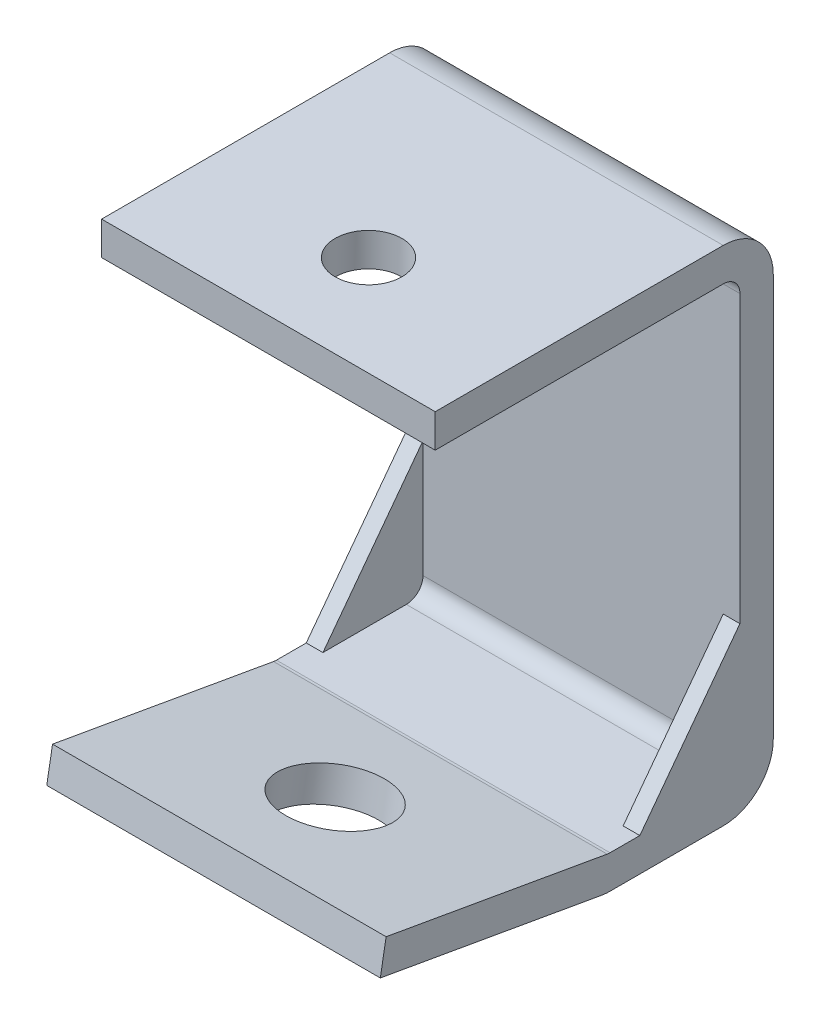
from build123d import *

# Parameters (mm, degrees)
BASE_EXTRUDE_THIN_DEPTH = 31.75
CUT_EXTRUDE1_REACH      = 123.868
SKETCH2_R               = 6.35
BOSS_EXTRUDE1_DEPTH     = 3.175
SKETCH4_R               = 9.525
CUT_EXTRUDE2_DEPTH      = 120.81835719


with BuildPart() as part:
    # Sketch1 → Base-Extrude-Thin (new, symmetric)
    with BuildSketch(Plane(origin=(0, 0, 0), x_dir=(0, 0, -1), z_dir=(1, 0, 0))):
        with BuildLine():
            Line((-67.34673338, 7.46687164), (-25.273556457, 0.048235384))
            ThreePointArc((-25.273556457, 0.048235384), (-24.998942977, 0.012081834), (-24.722223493, 0))
            Line((-24.722223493, 0), (-3.175, 0))
            ThreePointArc((-3.175, 0), (-0.92993597, 0.92993597), (0, 3.175))
            Line((0, 3.175), (0, 79.825))
            ThreePointArc((0, 79.825), (-0.92993597, 82.07006403), (-3.175, 83))
            Line((-3.175, 83), (-58, 83))
            Line((-58, 83), (-58, 89.35))
            Line((-58, 89.35), (-3.175, 89.35))
            ThreePointArc((-3.175, 89.35), (3.560192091, 86.560192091), (6.35, 79.825))
            Line((6.35, 79.825), (6.35, 3.175))
            ThreePointArc((6.35, 3.175), (3.560192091, -3.560192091), (-3.175, -6.35))
            Line((-3.175, -6.35), (-24.722223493, -6.35))
            ThreePointArc((-24.722223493, -6.35), (-25.552381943, -6.313754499), (-26.376222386, -6.205293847))
            Line((-26.376222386, -6.205293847), (-68.449399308, 1.213342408))
            Line((-68.449399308, 1.213342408), (-67.34673338, 7.46687164))
        make_face()
    extrude(amount=BASE_EXTRUDE_THIN_DEPTH, both=True)

    # Sketch2 → Cut-Extrude1 (cut, up to next)
    with BuildSketch(Plane(origin=(0, 89.35, 0), x_dir=(-1, 0, 0), z_dir=(0, 1, 0)), mode=Mode.PRIVATE) as cut_extrude1_sk1:
        with Locations(Location((0, 38.95, 0), (0, 0, 90))):
            Circle(SKETCH2_R)
    cut_extrude1_tool1 = extrude(cut_extrude1_sk1.sketch, amount=-CUT_EXTRUDE1_REACH, mode=Mode.PRIVATE) & part.part
    add(cut_extrude1_tool1.solids().sort_by_distance((0, 89.35, 38.95))[0], mode=Mode.SUBTRACT)

    # Sketch3 → Boss-Extrude1 (add)
    with BuildSketch(Plane(origin=(31.75, 0, 0), x_dir=(0, 0, -1), z_dir=(1, 0, 0))):
        with BuildLine():
            Line((-19.05, 0), (-3.175, 0))
            ThreePointArc((-3.175, 0), (-0.92993597, 0.92993597), (0, 3.175))
            Line((0, 3.175), (0, 25.4))
            Line((0, 25.4), (-19.05, 0))
        make_face()
    boss_extrude1 = extrude(amount=-BOSS_EXTRUDE1_DEPTH)

    # Mirror1: Boss-Extrude1 across plane
    add(boss_extrude1.mirror(Plane(origin=(0, 0, 0), x_dir=(0, 0, 1), z_dir=(1, 0, 0))))

    # Sketch4 → Cut-Extrude2 (cut, through all)
    with BuildSketch(Plane(origin=(0, -4.275251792, 0.75384224), x_dir=(-1, 0, 0), z_dir=(0, 0.984807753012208, -0.17364817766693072))):
        with Locations(Location((0, 45.239836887, 0), (0, 0, 90))):
            Circle(SKETCH4_R)
    extrude(amount=-CUT_EXTRUDE2_DEPTH, mode=Mode.SUBTRACT)


solid = part.part
